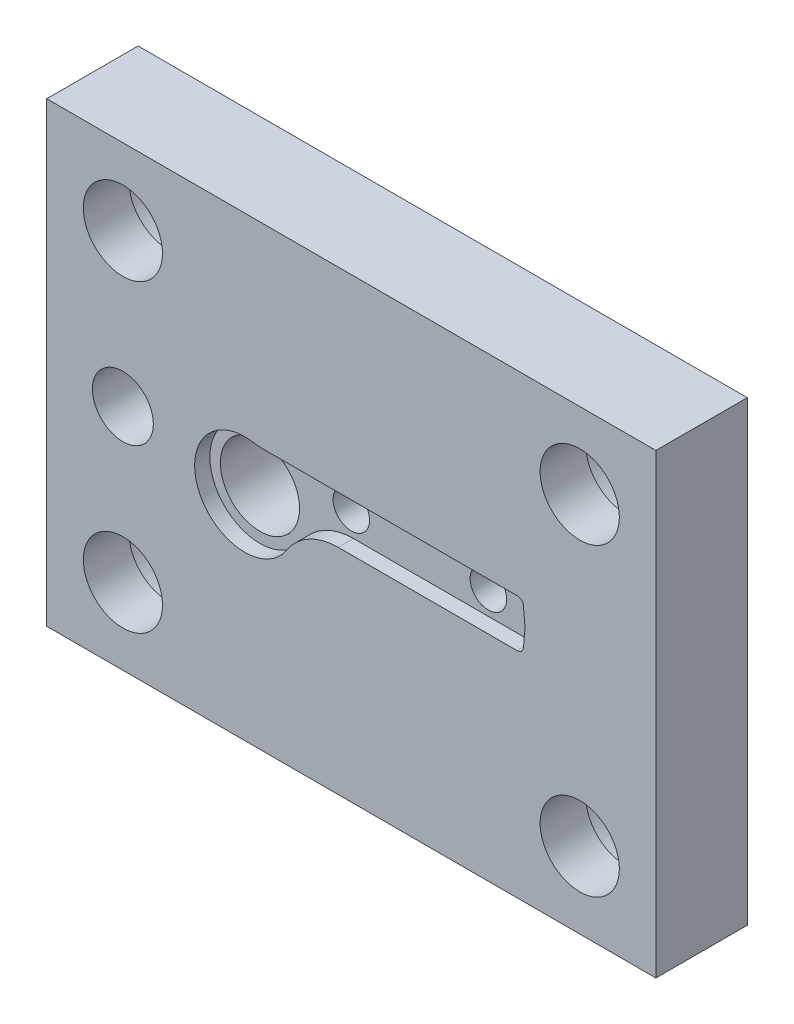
from build123d import *

# Parameters (mm, degrees)
ESQUISSE1_W                                        = 200
ESQUISSE1_H                                        = 150
BASE_EXTRUSION_DEPTH                               = 30
ENL_V_MAT_EXTRU_1_DEPTH                            = 5
ESQUISSE3_R                                        = 13
ENL_V_MAT_EXTRU_2_DEPTH                            = 252.246890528
ESQUISSE6_R                                        = 6
ENL_V_MAT_EXTRU_5_DEPTH                            = 13
ESQUISSE7_R                                        = 9
ENL_V_MAT_EXTRU_6_DEPTH                            = 251.647162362
ESQUISSE8_R                                        = 13
ENL_V_MAT_EXTRU_7_DEPTH                            = 15
ESQUISSE9_R                                        = 20
ENL_V_MAT_EXTRU_8_DEPTH                            = 251.449595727
CHAMBRAGE_POUR_VIS_T_TE_HEXAGONALE_M41_D           = 12
CHAMBRAGE_POUR_VIS_T_TE_HEXAGONALE_M41_CBORE_D     = 20
CHAMBRAGE_POUR_VIS_T_TE_HEXAGONALE_M41_CBORE_DEPTH = 21.5


with BuildPart() as part:
    # Esquisse1 → Base-Extrusion (new body)
    with BuildSketch(Plane.XY):
        with Locations((100, 75)):
            Rectangle(ESQUISSE1_W, ESQUISSE1_H)
    extrude(amount=BASE_EXTRUSION_DEPTH)

    # Esquisse2 → Enl_v. mat.-Extru.1 (cut)
    with BuildSketch(Plane.XY.offset(30)):
        with BuildLine():
            Line((71.07819052, 85.935), (154.489847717, 85.935))
            ThreePointArc((154.489847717, 85.935), (155.861295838, 85.401672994), (156.512122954, 84.081926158))
            Line((156.512122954, 84.081926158), (157.033723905, 78.12))
            Line((157.033723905, 78.12), (156.512122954, 72.158073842))
            ThreePointArc((156.512122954, 72.158073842), (155.861295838, 70.838327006), (154.489847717, 70.305))
            Line((154.489847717, 70.305), (95.681427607, 70.305))
            ThreePointArc((95.681427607, 70.305), (86.083538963, 67.855711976), (78.832928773, 61.106850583))
            ThreePointArc((78.832928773, 61.106850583), (49.957582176, 63.354423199), (67.740393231, 86.215063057))
            ThreePointArc((67.740393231, 86.215063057), (69.403427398, 86.005138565), (71.07819052, 85.935))
        make_face()
    extrude(amount=-ENL_V_MAT_EXTRU_1_DEPTH, mode=Mode.SUBTRACT)

    # Esquisse3 → Enl_v. mat.-Extru.2 (cut, through all)
    with BuildSketch(Plane.XY.offset(25)):
        with Locations((65, 70)):
            Circle(ESQUISSE3_R)
    extrude(amount=-ENL_V_MAT_EXTRU_2_DEPTH, mode=Mode.SUBTRACT)

    # Esquisse6 → Enl_v. mat.-Extru.5 (cut)
    with BuildSketch(Plane.XY.offset(25)):
        with Locations((140, 78.12)):
            Circle(ESQUISSE6_R)
        with Locations((95, 78.12)):
            Circle(ESQUISSE6_R)
    extrude(amount=-ENL_V_MAT_EXTRU_5_DEPTH, mode=Mode.SUBTRACT)

    # Esquisse7 → Enl_v. mat.-Extru.6 (cut, through all)
    with BuildSketch(Plane.XY.offset(12)):
        with Locations((140, 78.12)):
            Circle(ESQUISSE7_R)
        with Locations((95, 78.12)):
            Circle(ESQUISSE7_R)
    extrude(amount=-ENL_V_MAT_EXTRU_6_DEPTH, mode=Mode.SUBTRACT)

    # Esquisse8 → Enl_v. mat.-Extru.7 (cut)
    with BuildSketch(Plane.XY.offset(30)):
        with Locations((25, 125)):
            Circle(ESQUISSE8_R)
        with Locations((25, 25)):
            Circle(ESQUISSE8_R)
        with Locations((175, 25)):
            Circle(ESQUISSE8_R)
        with Locations((175, 125)):
            Circle(ESQUISSE8_R)
    extrude(amount=-ENL_V_MAT_EXTRU_7_DEPTH, mode=Mode.SUBTRACT)

    # Esquisse9 → Enl_v. mat.-Extru.8 (cut, through all)
    with BuildSketch(Plane.XY.offset(15)):
        with Locations((25, 125)):
            Circle(ESQUISSE9_R)
        with Locations((175, 125)):
            Circle(ESQUISSE9_R)
        with Locations((175, 25)):
            Circle(ESQUISSE9_R)
        with Locations((25, 25)):
            Circle(ESQUISSE9_R)
    extrude(amount=-ENL_V_MAT_EXTRU_8_DEPTH, mode=Mode.SUBTRACT)

    # Chambrage pour vis _ t_te hexagonale M41 (through all)
    with Locations(Plane.XY.offset(30)):
        with Locations((25, 75)):
            CounterBoreHole(CHAMBRAGE_POUR_VIS_T_TE_HEXAGONALE_M41_D / 2, CHAMBRAGE_POUR_VIS_T_TE_HEXAGONALE_M41_CBORE_D / 2, CHAMBRAGE_POUR_VIS_T_TE_HEXAGONALE_M41_CBORE_DEPTH)


solid = part.part
